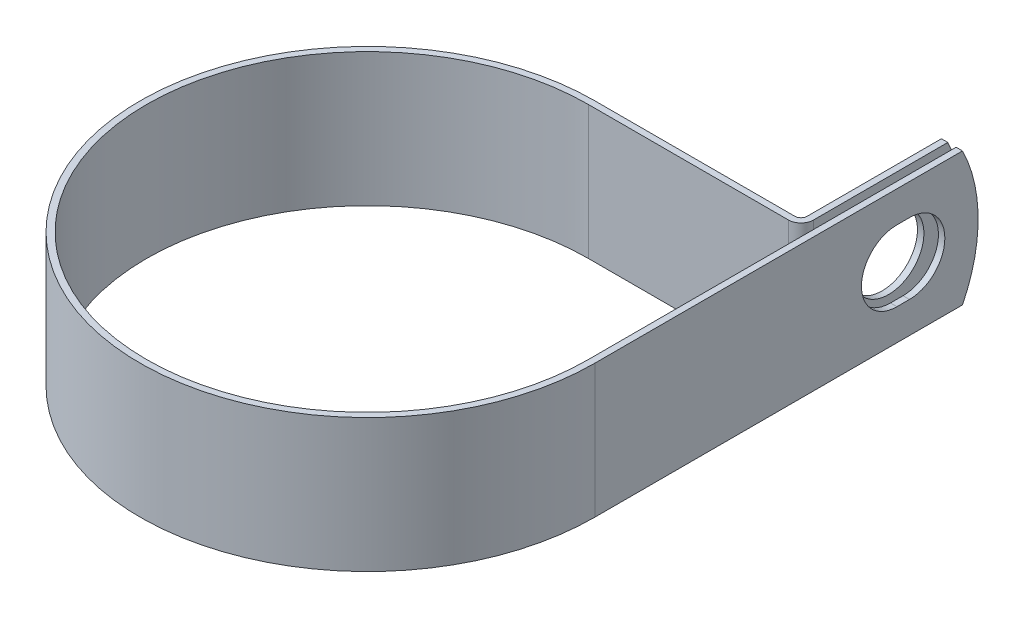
from build123d import *

# Parameters (mm, degrees)
EXTRUDE_THIN1_DEPTH = 12.7
SKETCH2_R           = 6.7437
CUT_EXTRUDE1_DEPTH  = 1.2192
CUT_EXTRUDE2_REACH  = 115.945
CUT_EXTRUDE3_DEPTH  = 111.926705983


with BuildPart() as part:
    # Sketch1 → Extrude-Thin1 (new, symmetric)
    with BuildSketch(Plane(origin=(0, 0, 0), x_dir=(1, 0, 0), z_dir=(0, 1, 0))):
        with BuildLine():
            Line((42.0624, 72.9996), (42.0624, 42.0624))
            Line((42.0624, 42.0624), (42.0624, 0))
            ThreePointArc((42.0624, 0), (-29.742608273, -29.742608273), (0, 42.0624))
            Line((0, 42.0624), (38.11016, 42.0624))
            ThreePointArc((38.11016, 42.0624), (39.791263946, 42.758736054), (40.4876, 44.43984))
            Line((40.4876, 44.43984), (40.4876, 72.9996))
            Line((40.4876, 72.9996), (39.2684, 72.9996))
            Line((39.2684, 72.9996), (39.2684, 44.43984))
            ThreePointArc((39.2684, 44.43984), (38.929159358, 43.620840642), (38.11016, 43.2816))
            Line((38.11016, 43.2816), (0, 43.2816))
            ThreePointArc((0, 43.2816), (-30.604712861, -30.604712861), (43.2816, 0))
            Line((43.2816, 0), (43.2816, 42.0624))
            Line((43.2816, 42.0624), (43.2816, 72.9996))
            Line((43.2816, 72.9996), (42.0624, 72.9996))
        make_face()
    extrude(amount=EXTRUDE_THIN1_DEPTH, both=True)

    # Sketch2 → Cut-Extrude1 (cut)
    with BuildSketch(Plane.ZY.offset(-39.2684)):
        with Locations((-58.7248, 0)):
            Circle(SKETCH2_R)
    extrude(amount=-CUT_EXTRUDE1_DEPTH, mode=Mode.SUBTRACT)

    # Sketch3 → Cut-Extrude2 (cut, up to next)
    with BuildSketch(Plane(origin=(43.2816, 0, 0), x_dir=(0, 0, -1), z_dir=(1, 0, 0)), mode=Mode.PRIVATE) as cut_extrude2_sk1:
        with BuildLine():
            Line((57.531, 6.7437), (59.9186, 6.7437))
            ThreePointArc((59.9186, 6.7437), (66.6623, 0), (59.9186, -6.7437))
            Line((59.9186, -6.7437), (57.531, -6.7437))
            ThreePointArc((57.531, -6.7437), (50.7873, 0), (57.531, 6.7437))
        make_face()
    cut_extrude2_tool1 = extrude(cut_extrude2_sk1.sketch, amount=-CUT_EXTRUDE2_REACH, mode=Mode.PRIVATE) & part.part
    add(cut_extrude2_tool1.solids().sort_by_distance((43.2816, 0, -58.7248))[0], mode=Mode.SUBTRACT)

    # Sketch4 → Cut-Extrude3 (cut, through all)
    with BuildSketch(Plane.ZY.offset(-39.2684)):
        with BuildLine():
            Line((-70.022268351, 12.7), (-72.9996, 12.7))
            Line((-72.9996, 12.7), (-72.9996, 0))
            ThreePointArc((-72.9996, 0), (-72.245311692, 6.522164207), (-70.022268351, 12.7))
        make_face()
        with BuildLine():
            ThreePointArc((-70.022268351, -12.7), (-72.245311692, -6.522164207), (-72.9996, 0))
            Line((-72.9996, 0), (-72.9996, -12.7))
            Line((-72.9996, -12.7), (-70.022268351, -12.7))
        make_face()
    extrude(amount=-CUT_EXTRUDE3_DEPTH, mode=Mode.SUBTRACT)


solid = part.part
